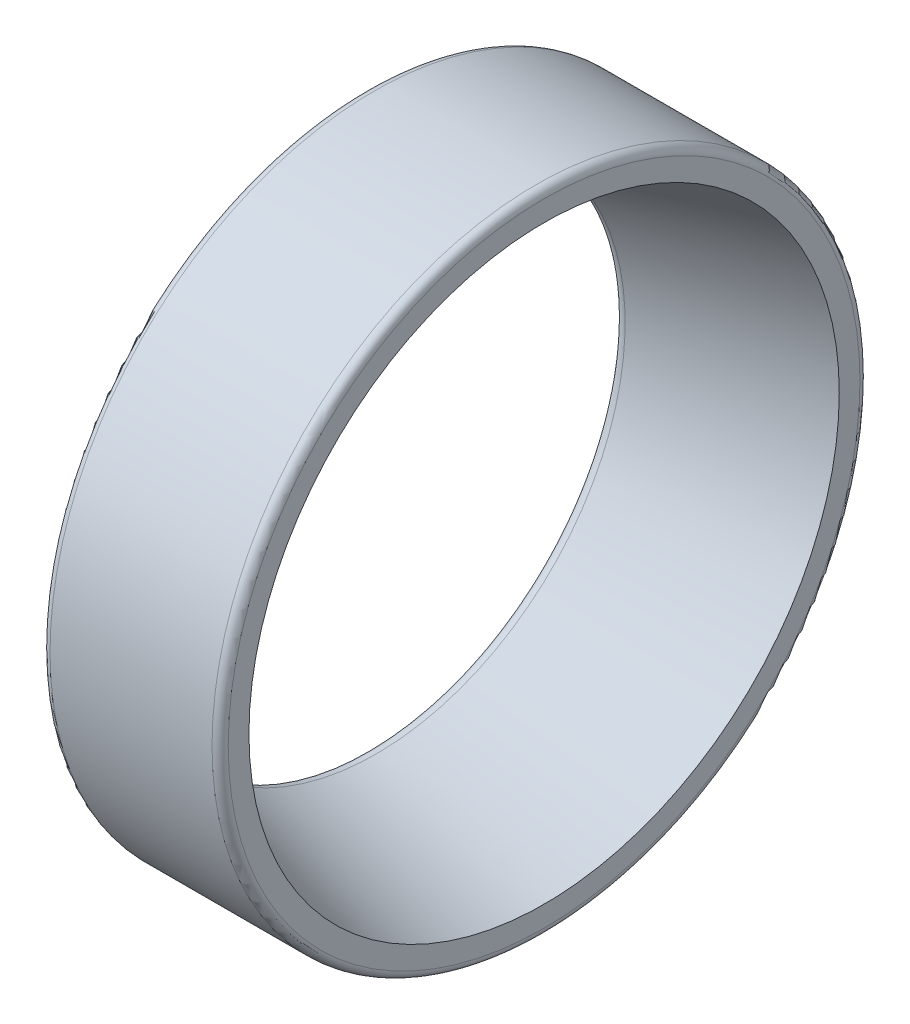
ISO-10303-21;
HEADER;
FILE_DESCRIPTION(('STEP AP214'),'2;1');
FILE_NAME('part.step','',(''),(''),'','','');
FILE_SCHEMA(('AUTOMOTIVE_DESIGN { 1 0 10303 214 1 1 1 1 }'));
ENDSEC;
DATA;
#1=APPLICATION_CONTEXT('core data for automotive mechanical design processes');
#2=APPLICATION_PROTOCOL_DEFINITION('international standard','automotive_design',2000,#1);
#3=PRODUCT_CONTEXT('',#1,'mechanical');
#4=PRODUCT('Part','Part','',(#3));
#5=PRODUCT_RELATED_PRODUCT_CATEGORY('part','',(#4));
#6=PRODUCT_DEFINITION_FORMATION('','',#4);
#7=PRODUCT_DEFINITION_CONTEXT('part definition',#1,'design');
#8=PRODUCT_DEFINITION('design','',#6,#7);
#9=PRODUCT_DEFINITION_SHAPE('','',#8);
#10=(LENGTH_UNIT() NAMED_UNIT(*) SI_UNIT(.MILLI.,.METRE.));
#11=(NAMED_UNIT(*) PLANE_ANGLE_UNIT() SI_UNIT($,.RADIAN.));
#12=(NAMED_UNIT(*) SI_UNIT($,.STERADIAN.) SOLID_ANGLE_UNIT());
#13=UNCERTAINTY_MEASURE_WITH_UNIT(LENGTH_MEASURE(1.E-05),#10,'distance_accuracy_value','');
#14=(GEOMETRIC_REPRESENTATION_CONTEXT(3) GLOBAL_UNCERTAINTY_ASSIGNED_CONTEXT((#13)) GLOBAL_UNIT_ASSIGNED_CONTEXT((#10,
#11,#12)) REPRESENTATION_CONTEXT('',''));
#15=CARTESIAN_POINT('',(0.,0.,0.));
#16=DIRECTION('',(0.,0.,1.));
#17=DIRECTION('',(1.,0.,0.));
#18=AXIS2_PLACEMENT_3D('',#15,#16,#17);
#19=CARTESIAN_POINT('',(0.5,0.,0.));
#20=DIRECTION('',(-1.,0.,0.));
#21=DIRECTION('',(0.,0.,1.));
#22=AXIS2_PLACEMENT_3D('',#19,#20,#21);
#23=TOROIDAL_SURFACE('',#22,15.8536522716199,0.500000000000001);
#24=CARTESIAN_POINT('',(0.632517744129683,0.,0.));
#25=DIRECTION('',(-1.,0.,0.));
#26=DIRECTION('',(0.,0.,1.));
#27=AXIS2_PLACEMENT_3D('',#24,#25,#26);
#28=CIRCLE('',#27,15.3715329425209);
#29=CARTESIAN_POINT('',(0.632517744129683,0.,15.3715329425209));
#30=VERTEX_POINT('',#29);
#31=EDGE_CURVE('E10',#30,#30,#28,.T.);
#32=ORIENTED_EDGE('',*,*,#31,.F.);
#33=EDGE_LOOP('',(#32));
#34=FACE_BOUND('',#33,.T.);
#35=CARTESIAN_POINT('',(0.,0.,0.));
#36=DIRECTION('',(-1.,0.,0.));
#37=DIRECTION('',(0.,0.,1.));
#38=AXIS2_PLACEMENT_3D('',#35,#36,#37);
#39=CIRCLE('',#38,15.8536522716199);
#40=CARTESIAN_POINT('',(0.,0.,15.8536522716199));
#41=VERTEX_POINT('',#40);
#42=EDGE_CURVE('E57',#41,#41,#39,.T.);
#43=ORIENTED_EDGE('',*,*,#42,.T.);
#44=EDGE_LOOP('',(#43));
#45=FACE_BOUND('',#44,.T.);
#46=ADVANCED_FACE('F32',(#34,#45),#23,.T.);
#47=CARTESIAN_POINT('',(9.76830449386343,0.,0.));
#48=DIRECTION('',(1.,0.,0.));
#49=DIRECTION('',(0.,0.,-1.));
#50=AXIS2_PLACEMENT_3D('',#47,#48,#49);
#51=CONICAL_SURFACE('',#50,17.8826412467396,0.268240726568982);
#52=CARTESIAN_POINT('',(11.,0.,0.));
#53=DIRECTION('',(-1.,0.,0.));
#54=DIRECTION('',(0.,0.,1.));
#55=AXIS2_PLACEMENT_3D('',#52,#53,#54);
#56=CIRCLE('',#55,18.221191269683);
#57=CARTESIAN_POINT('',(11.,0.,18.221191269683));
#58=VERTEX_POINT('',#57);
#59=EDGE_CURVE('E38',#58,#58,#56,.T.);
#60=ORIENTED_EDGE('',*,*,#59,.F.);
#61=EDGE_LOOP('',(#60));
#62=FACE_BOUND('',#61,.T.);
#63=ORIENTED_EDGE('',*,*,#31,.T.);
#64=EDGE_LOOP('',(#63));
#65=FACE_BOUND('',#64,.T.);
#66=ADVANCED_FACE('F88',(#62,#65),#51,.F.);
#67=CARTESIAN_POINT('',(11.,0.,-19.5));
#68=DIRECTION('',(-1.,0.,0.));
#69=DIRECTION('',(0.,0.,1.));
#70=AXIS2_PLACEMENT_3D('',#67,#68,#69);
#71=PLANE('',#70);
#72=CARTESIAN_POINT('',(11.,0.,0.));
#73=DIRECTION('',(-1.,0.,0.));
#74=DIRECTION('',(0.,0.,1.));
#75=AXIS2_PLACEMENT_3D('',#72,#73,#74);
#76=CIRCLE('',#75,19.5);
#77=CARTESIAN_POINT('',(11.,0.,19.5));
#78=VERTEX_POINT('',#77);
#79=EDGE_CURVE('E42',#78,#78,#76,.T.);
#80=ORIENTED_EDGE('',*,*,#79,.F.);
#81=EDGE_LOOP('',(#80));
#82=FACE_BOUND('',#81,.T.);
#83=ORIENTED_EDGE('',*,*,#59,.T.);
#84=EDGE_LOOP('',(#83));
#85=FACE_BOUND('',#84,.T.);
#86=ADVANCED_FACE('F83',(#82,#85),#71,.F.);
#87=CARTESIAN_POINT('',(10.5,0.,0.));
#88=DIRECTION('',(-1.,0.,0.));
#89=DIRECTION('',(0.,0.,1.));
#90=AXIS2_PLACEMENT_3D('',#87,#88,#89);
#91=TOROIDAL_SURFACE('',#90,19.5,0.500000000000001);
#92=CARTESIAN_POINT('',(10.5,0.,0.));
#93=DIRECTION('',(-1.,0.,0.));
#94=DIRECTION('',(0.,0.,1.));
#95=AXIS2_PLACEMENT_3D('',#92,#93,#94);
#96=CIRCLE('',#95,20.);
#97=CARTESIAN_POINT('',(10.5,0.,20.));
#98=VERTEX_POINT('',#97);
#99=EDGE_CURVE('E46',#98,#98,#96,.T.);
#100=ORIENTED_EDGE('',*,*,#99,.F.);
#101=EDGE_LOOP('',(#100));
#102=FACE_BOUND('',#101,.T.);
#103=ORIENTED_EDGE('',*,*,#79,.T.);
#104=EDGE_LOOP('',(#103));
#105=FACE_BOUND('',#104,.T.);
#106=ADVANCED_FACE('F77',(#102,#105),#91,.T.);
#107=CARTESIAN_POINT('',(0.,0.,0.));
#108=DIRECTION('',(-1.,0.,0.));
#109=DIRECTION('',(0.,0.,1.));
#110=AXIS2_PLACEMENT_3D('',#107,#108,#109);
#111=CYLINDRICAL_SURFACE('',#110,20.);
#112=CARTESIAN_POINT('',(0.5,0.,0.));
#113=DIRECTION('',(-1.,0.,0.));
#114=DIRECTION('',(0.,0.,1.));
#115=AXIS2_PLACEMENT_3D('',#112,#113,#114);
#116=CIRCLE('',#115,20.);
#117=CARTESIAN_POINT('',(0.5,0.,20.));
#118=VERTEX_POINT('',#117);
#119=EDGE_CURVE('E51',#118,#118,#116,.T.);
#120=ORIENTED_EDGE('',*,*,#119,.F.);
#121=EDGE_LOOP('',(#120));
#122=FACE_BOUND('',#121,.T.);
#123=ORIENTED_EDGE('',*,*,#99,.T.);
#124=EDGE_LOOP('',(#123));
#125=FACE_BOUND('',#124,.T.);
#126=ADVANCED_FACE('F71',(#122,#125),#111,.T.);
#127=CARTESIAN_POINT('',(0.5,0.,0.));
#128=DIRECTION('',(-1.,0.,0.));
#129=DIRECTION('',(0.,0.,1.));
#130=AXIS2_PLACEMENT_3D('',#127,#128,#129);
#131=TOROIDAL_SURFACE('',#130,19.5,0.5);
#132=CARTESIAN_POINT('',(0.,0.,0.));
#133=DIRECTION('',(-1.,0.,0.));
#134=DIRECTION('',(0.,0.,1.));
#135=AXIS2_PLACEMENT_3D('',#132,#133,#134);
#136=CIRCLE('',#135,19.5);
#137=CARTESIAN_POINT('',(0.,0.,19.5));
#138=VERTEX_POINT('',#137);
#139=EDGE_CURVE('E54',#138,#138,#136,.T.);
#140=ORIENTED_EDGE('',*,*,#139,.F.);
#141=EDGE_LOOP('',(#140));
#142=FACE_BOUND('',#141,.T.);
#143=ORIENTED_EDGE('',*,*,#119,.T.);
#144=EDGE_LOOP('',(#143));
#145=FACE_BOUND('',#144,.T.);
#146=ADVANCED_FACE('F65',(#142,#145),#131,.T.);
#147=CARTESIAN_POINT('',(0.,0.,-15.8536522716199));
#148=DIRECTION('',(1.,0.,0.));
#149=DIRECTION('',(0.,0.,-1.));
#150=AXIS2_PLACEMENT_3D('',#147,#148,#149);
#151=PLANE('',#150);
#152=ORIENTED_EDGE('',*,*,#42,.F.);
#153=EDGE_LOOP('',(#152));
#154=FACE_BOUND('',#153,.T.);
#155=ORIENTED_EDGE('',*,*,#139,.T.);
#156=EDGE_LOOP('',(#155));
#157=FACE_BOUND('',#156,.T.);
#158=ADVANCED_FACE('F62',(#154,#157),#151,.F.);
#159=CLOSED_SHELL('',(#46,#66,#86,#106,#126,#146,#158));
#160=MANIFOLD_SOLID_BREP('B2',#159);
#161=ADVANCED_BREP_SHAPE_REPRESENTATION('',(#18,#160),#14);
#162=SHAPE_DEFINITION_REPRESENTATION(#9,#161);
ENDSEC;
END-ISO-10303-21;
